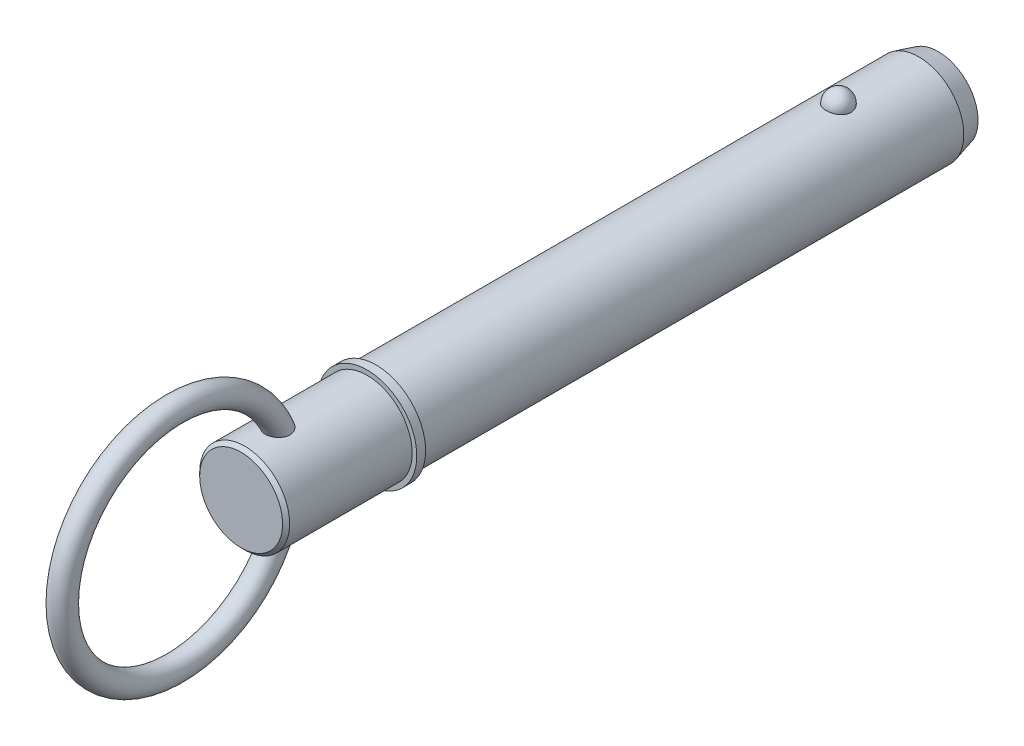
from build123d import *

# Parameters (mm, degrees)
SKETCH2_R           = 12.7
BOSS_EXTRUDE1_DEPTH = 127
BOSS_EXTRUDE2_START = 31.75
SKETCH3_R           = 12.7
BOSS_EXTRUDE2_DEPTH = 31.75
CHAMFER1_SIZE       = 5.5
CHAMFER1_SIZE2      = 1.473720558
SKETCH20_W          = 2.5
SKETCH20_H          = 14
SKETCH21_R          = 12.7
BOSS_EXTRUDE3_DEPTH = 38.1
CHAMFER2_SIZE       = 1
SKETCH24_R          = 3.25


with BuildPart() as part:
    # Sketch2 → Boss-Extrude1 (new body)
    with BuildSketch(Plane.XY):
        Circle(SKETCH2_R)
    extrude(amount=BOSS_EXTRUDE1_DEPTH)

    # Sketch3 → Boss-Extrude2 (add)
    with BuildSketch(Plane(origin=(0, 0, 0), x_dir=(-1, 0, 0), z_dir=(0, 0, -1)).offset(BOSS_EXTRUDE2_START)):
        Circle(SKETCH3_R)
    extrude(amount=-BOSS_EXTRUDE2_DEPTH)

    # Chamfer1
    chamfer1_edges = [part.edges().sort_by_distance(p)[0] for p in [
        (12.7, 0, -31.75),
    ]]
    chamfer1_side = [part.faces().sort_by_distance(p)[0] for p in [
        (12.7, 0, -15.875),
    ]]
    chamfer(chamfer1_edges, length=CHAMFER1_SIZE, length2=CHAMFER1_SIZE2, reference=chamfer1_side[0])

    # Sketch18 → Revolve1 (revolve)
    with BuildSketch(Plane(origin=(0, 0, 0), x_dir=(0, 0, -1), z_dir=(1, 0, 0))):
        with BuildLine():
            Line((3.56, 16.26), (3.56, 9.14))
            ThreePointArc((3.56, 9.14), (0, 12.7), (3.56, 16.26))
        make_face()
    revolve(axis=Axis((0, 16.26, -3.56), (0, -1, 0)))

    # Sketch20 → Revolve2 (revolve)
    with BuildSketch(Plane(origin=(0, 0, 0), x_dir=(0, 0, -1), z_dir=(1, 0, 0)), mode=Mode.PRIVATE) as revolve2_sk:
        with Locations((-128.25, 7)):
            Rectangle(SKETCH20_W, SKETCH20_H)
    revolve(revolve2_sk.sketch.rotate(Axis((0, 0, 33.728787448), (0, 0, 1)), 90), axis=Axis((0, 0, 33.728787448), (0, 0, 1)))

    # Sketch21 → Boss-Extrude3 (add)
    with BuildSketch(Plane(origin=(0, 0, 127), x_dir=(-1, 0, 0), z_dir=(0, 0, -1))):
        Circle(SKETCH21_R)
    extrude(amount=-BOSS_EXTRUDE3_DEPTH)

    # Chamfer2
    chamfer2_edges = [part.edges().sort_by_distance(p)[0] for p in [
        (12.7, 0, 165.1),
    ]]
    chamfer(chamfer2_edges, length=CHAMFER2_SIZE)

    # Sweep1: sweep along a path in Sketch23
    with BuildLine(Plane(origin=(0, 0, 0), x_dir=(0, 0, -1), z_dir=(1, 0, 0))) as sweep1_path:
        CenterArc((-183.85, 0), 31.75, 0, 360)
    # Sketch24 → Sweep1 (sweep)
    with BuildSketch(Plane(origin=(0, 0, 0), x_dir=(1, 0, 0), z_dir=(0, 1, 0))):
        with Locations((0, -152.1)):
            Circle(SKETCH24_R)
    sweep(path=sweep1_path.line)


solid = part.part
